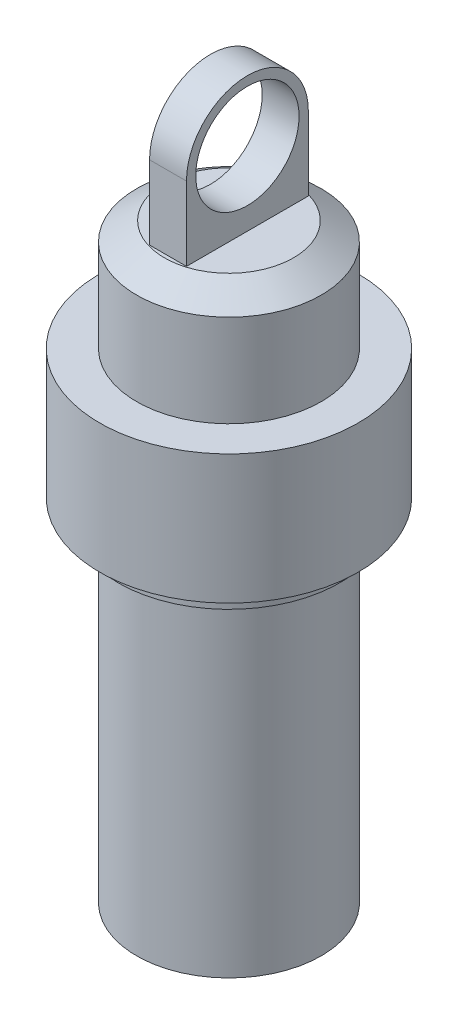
ISO-10303-21;
HEADER;
FILE_DESCRIPTION(('STEP AP214'),'2;1');
FILE_NAME('part.step','',(''),(''),'','','');
FILE_SCHEMA(('AUTOMOTIVE_DESIGN { 1 0 10303 214 1 1 1 1 }'));
ENDSEC;
DATA;
#1=APPLICATION_CONTEXT('core data for automotive mechanical design processes');
#2=APPLICATION_PROTOCOL_DEFINITION('international standard','automotive_design',2000,#1);
#3=PRODUCT_CONTEXT('',#1,'mechanical');
#4=PRODUCT('Part','Part','',(#3));
#5=PRODUCT_RELATED_PRODUCT_CATEGORY('part','',(#4));
#6=PRODUCT_DEFINITION_FORMATION('','',#4);
#7=PRODUCT_DEFINITION_CONTEXT('part definition',#1,'design');
#8=PRODUCT_DEFINITION('design','',#6,#7);
#9=PRODUCT_DEFINITION_SHAPE('','',#8);
#10=(LENGTH_UNIT() NAMED_UNIT(*) SI_UNIT(.MILLI.,.METRE.));
#11=(NAMED_UNIT(*) PLANE_ANGLE_UNIT() SI_UNIT($,.RADIAN.));
#12=(NAMED_UNIT(*) SI_UNIT($,.STERADIAN.) SOLID_ANGLE_UNIT());
#13=UNCERTAINTY_MEASURE_WITH_UNIT(LENGTH_MEASURE(1.E-05),#10,'distance_accuracy_value','');
#14=(GEOMETRIC_REPRESENTATION_CONTEXT(3) GLOBAL_UNCERTAINTY_ASSIGNED_CONTEXT((#13)) GLOBAL_UNIT_ASSIGNED_CONTEXT((#10,
#11,#12)) REPRESENTATION_CONTEXT('',''));
#15=CARTESIAN_POINT('',(0.,0.,0.));
#16=DIRECTION('',(0.,0.,1.));
#17=DIRECTION('',(1.,0.,0.));
#18=AXIS2_PLACEMENT_3D('',#15,#16,#17);
#19=CARTESIAN_POINT('',(-1.,32.,0.));
#20=DIRECTION('',(0.,1.,0.));
#21=DIRECTION('',(0.,0.,1.));
#22=AXIS2_PLACEMENT_3D('',#19,#20,#21);
#23=PLANE('',#22);
#24=DIRECTION('',(1.,0.,0.));
#25=VECTOR('',#24,1.);
#26=CARTESIAN_POINT('',(-1.,32.,-3.3));
#27=LINE('',#26,#25);
#28=CARTESIAN_POINT('',(-1.,32.,-3.3));
#29=VERTEX_POINT('',#28);
#30=CARTESIAN_POINT('',(1.,32.,-3.3));
#31=VERTEX_POINT('',#30);
#32=EDGE_CURVE('E47',#29,#31,#27,.T.);
#33=ORIENTED_EDGE('',*,*,#32,.T.);
#34=DIRECTION('',(0.,0.,1.));
#35=VECTOR('',#34,1.);
#36=CARTESIAN_POINT('',(1.,32.,0.));
#37=LINE('',#36,#35);
#38=CARTESIAN_POINT('',(1.,32.,3.3));
#39=VERTEX_POINT('',#38);
#40=EDGE_CURVE('E86',#31,#39,#37,.T.);
#41=ORIENTED_EDGE('',*,*,#40,.T.);
#42=DIRECTION('',(1.,0.,0.));
#43=VECTOR('',#42,1.);
#44=CARTESIAN_POINT('',(-1.,32.,3.3));
#45=LINE('',#44,#43);
#46=CARTESIAN_POINT('',(-1.,32.,3.3));
#47=VERTEX_POINT('',#46);
#48=EDGE_CURVE('E12',#47,#39,#45,.T.);
#49=ORIENTED_EDGE('',*,*,#48,.F.);
#50=DIRECTION('',(0.,0.,1.));
#51=VECTOR('',#50,1.);
#52=CARTESIAN_POINT('',(-1.,32.,0.));
#53=LINE('',#52,#51);
#54=EDGE_CURVE('E88',#29,#47,#53,.T.);
#55=ORIENTED_EDGE('',*,*,#54,.F.);
#56=EDGE_LOOP('',(#33,#41,#49,#55));
#57=FACE_BOUND('',#56,.T.);
#58=ADVANCED_FACE('F44',(#57),#23,.F.);
#59=CARTESIAN_POINT('',(-1.,0.,3.3));
#60=DIRECTION('',(0.,0.,-1.));
#61=DIRECTION('',(0.,1.,0.));
#62=AXIS2_PLACEMENT_3D('',#59,#60,#61);
#63=PLANE('',#62);
#64=ORIENTED_EDGE('',*,*,#48,.T.);
#65=DIRECTION('',(0.,1.,0.));
#66=VECTOR('',#65,1.);
#67=CARTESIAN_POINT('',(1.,0.,3.3));
#68=LINE('',#67,#66);
#69=CARTESIAN_POINT('',(1.,36.,3.3));
#70=VERTEX_POINT('',#69);
#71=EDGE_CURVE('E101',#39,#70,#68,.T.);
#72=ORIENTED_EDGE('',*,*,#71,.T.);
#73=DIRECTION('',(1.,0.,0.));
#74=VECTOR('',#73,1.);
#75=CARTESIAN_POINT('',(-1.,36.,3.3));
#76=LINE('',#75,#74);
#77=CARTESIAN_POINT('',(-1.,36.,3.3));
#78=VERTEX_POINT('',#77);
#79=EDGE_CURVE('E52',#78,#70,#76,.T.);
#80=ORIENTED_EDGE('',*,*,#79,.F.);
#81=DIRECTION('',(0.,1.,0.));
#82=VECTOR('',#81,1.);
#83=CARTESIAN_POINT('',(-1.,0.,3.3));
#84=LINE('',#83,#82);
#85=EDGE_CURVE('E59',#47,#78,#84,.T.);
#86=ORIENTED_EDGE('',*,*,#85,.F.);
#87=EDGE_LOOP('',(#64,#72,#80,#86));
#88=FACE_BOUND('',#87,.T.);
#89=ADVANCED_FACE('F124',(#88),#63,.F.);
#90=CARTESIAN_POINT('',(-1.,36.,0.));
#91=DIRECTION('',(1.,0.,0.));
#92=DIRECTION('',(0.,0.,-1.));
#93=AXIS2_PLACEMENT_3D('',#90,#91,#92);
#94=CYLINDRICAL_SURFACE('',#93,3.3);
#95=ORIENTED_EDGE('',*,*,#79,.T.);
#96=CARTESIAN_POINT('',(1.,36.,0.));
#97=DIRECTION('',(1.,0.,0.));
#98=DIRECTION('',(0.,0.,-1.));
#99=AXIS2_PLACEMENT_3D('',#96,#97,#98);
#100=CIRCLE('',#99,3.3);
#101=CARTESIAN_POINT('',(1.,36.,-3.3));
#102=VERTEX_POINT('',#101);
#103=EDGE_CURVE('E105',#102,#70,#100,.T.);
#104=ORIENTED_EDGE('',*,*,#103,.F.);
#105=DIRECTION('',(1.,0.,0.));
#106=VECTOR('',#105,1.);
#107=CARTESIAN_POINT('',(-1.,36.,-3.3));
#108=LINE('',#107,#106);
#109=CARTESIAN_POINT('',(-1.,36.,-3.3));
#110=VERTEX_POINT('',#109);
#111=EDGE_CURVE('E92',#110,#102,#108,.T.);
#112=ORIENTED_EDGE('',*,*,#111,.F.);
#113=CARTESIAN_POINT('',(-1.,36.,0.));
#114=DIRECTION('',(1.,0.,0.));
#115=DIRECTION('',(0.,0.,-1.));
#116=AXIS2_PLACEMENT_3D('',#113,#114,#115);
#117=CIRCLE('',#116,3.3);
#118=EDGE_CURVE('E116',#110,#78,#117,.T.);
#119=ORIENTED_EDGE('',*,*,#118,.T.);
#120=EDGE_LOOP('',(#95,#104,#112,#119));
#121=FACE_BOUND('',#120,.T.);
#122=ADVANCED_FACE('F123',(#121),#94,.T.);
#123=CARTESIAN_POINT('',(-1.,0.,-3.3));
#124=DIRECTION('',(0.,0.,1.));
#125=DIRECTION('',(0.,-1.,0.));
#126=AXIS2_PLACEMENT_3D('',#123,#124,#125);
#127=PLANE('',#126);
#128=ORIENTED_EDGE('',*,*,#111,.T.);
#129=DIRECTION('',(0.,-1.,0.));
#130=VECTOR('',#129,1.);
#131=CARTESIAN_POINT('',(1.,0.,-3.3));
#132=LINE('',#131,#130);
#133=EDGE_CURVE('E99',#102,#31,#132,.T.);
#134=ORIENTED_EDGE('',*,*,#133,.T.);
#135=ORIENTED_EDGE('',*,*,#32,.F.);
#136=DIRECTION('',(0.,-1.,0.));
#137=VECTOR('',#136,1.);
#138=CARTESIAN_POINT('',(-1.,0.,-3.3));
#139=LINE('',#138,#137);
#140=EDGE_CURVE('E114',#110,#29,#139,.T.);
#141=ORIENTED_EDGE('',*,*,#140,.F.);
#142=EDGE_LOOP('',(#128,#134,#135,#141));
#143=FACE_BOUND('',#142,.T.);
#144=ADVANCED_FACE('F103',(#143),#127,.F.);
#145=CARTESIAN_POINT('',(-1.,36.,0.));
#146=DIRECTION('',(1.,0.,0.));
#147=DIRECTION('',(0.,0.,-1.));
#148=AXIS2_PLACEMENT_3D('',#145,#146,#147);
#149=CYLINDRICAL_SURFACE('',#148,2.8);
#150=CARTESIAN_POINT('',(-1.,36.,0.));
#151=DIRECTION('',(1.,0.,0.));
#152=DIRECTION('',(0.,0.,-1.));
#153=AXIS2_PLACEMENT_3D('',#150,#151,#152);
#154=CIRCLE('',#153,2.8);
#155=CARTESIAN_POINT('',(-1.,36.,-2.8));
#156=VERTEX_POINT('',#155);
#157=EDGE_CURVE('E93',#156,#156,#154,.T.);
#158=ORIENTED_EDGE('',*,*,#157,.F.);
#159=EDGE_LOOP('',(#158));
#160=FACE_BOUND('',#159,.T.);
#161=CARTESIAN_POINT('',(1.,36.,0.));
#162=DIRECTION('',(1.,0.,0.));
#163=DIRECTION('',(0.,0.,-1.));
#164=AXIS2_PLACEMENT_3D('',#161,#162,#163);
#165=CIRCLE('',#164,2.8);
#166=CARTESIAN_POINT('',(1.,36.,-2.8));
#167=VERTEX_POINT('',#166);
#168=EDGE_CURVE('E110',#167,#167,#165,.T.);
#169=ORIENTED_EDGE('',*,*,#168,.T.);
#170=EDGE_LOOP('',(#169));
#171=FACE_BOUND('',#170,.T.);
#172=ADVANCED_FACE('F133',(#160,#171),#149,.F.);
#173=CARTESIAN_POINT('',(-1.,0.,0.));
#174=DIRECTION('',(1.,0.,0.));
#175=DIRECTION('',(0.,0.,-1.));
#176=AXIS2_PLACEMENT_3D('',#173,#174,#175);
#177=PLANE('',#176);
#178=ORIENTED_EDGE('',*,*,#54,.T.);
#179=ORIENTED_EDGE('',*,*,#85,.T.);
#180=ORIENTED_EDGE('',*,*,#118,.F.);
#181=ORIENTED_EDGE('',*,*,#140,.T.);
#182=EDGE_LOOP('',(#178,#179,#180,#181));
#183=FACE_BOUND('',#182,.T.);
#184=ORIENTED_EDGE('',*,*,#157,.T.);
#185=EDGE_LOOP('',(#184));
#186=FACE_BOUND('',#185,.T.);
#187=ADVANCED_FACE('F139',(#183,#186),#177,.F.);
#188=CARTESIAN_POINT('',(1.,0.,0.));
#189=DIRECTION('',(1.,0.,0.));
#190=DIRECTION('',(0.,0.,-1.));
#191=AXIS2_PLACEMENT_3D('',#188,#189,#190);
#192=PLANE('',#191);
#193=ORIENTED_EDGE('',*,*,#40,.F.);
#194=ORIENTED_EDGE('',*,*,#133,.F.);
#195=ORIENTED_EDGE('',*,*,#103,.T.);
#196=ORIENTED_EDGE('',*,*,#71,.F.);
#197=EDGE_LOOP('',(#193,#194,#195,#196));
#198=FACE_BOUND('',#197,.T.);
#199=ORIENTED_EDGE('',*,*,#168,.F.);
#200=EDGE_LOOP('',(#199));
#201=FACE_BOUND('',#200,.T.);
#202=ADVANCED_FACE('F96',(#198,#201),#192,.T.);
#203=CLOSED_SHELL('',(#58,#89,#122,#144,#172,#187,#202));
#204=MANIFOLD_SOLID_BREP('B2',#203);
#205=CARTESIAN_POINT('',(0.,27.,-0.75));
#206=DIRECTION('',(0.,-1.,0.));
#207=DIRECTION('',(0.,0.,-1.));
#208=AXIS2_PLACEMENT_3D('',#205,#206,#207);
#209=PLANE('',#208);
#210=CARTESIAN_POINT('',(0.,27.,0.));
#211=DIRECTION('',(0.,-1.,0.));
#212=DIRECTION('',(0.,0.,-1.));
#213=AXIS2_PLACEMENT_3D('',#210,#211,#212);
#214=CIRCLE('',#213,0.749999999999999);
#215=CARTESIAN_POINT('',(0.,27.,-0.75));
#216=VERTEX_POINT('',#215);
#217=EDGE_CURVE('E43',#216,#216,#214,.T.);
#218=ORIENTED_EDGE('',*,*,#217,.T.);
#219=EDGE_LOOP('',(#218));
#220=FACE_BOUND('',#219,.T.);
#221=ADVANCED_FACE('F200',(#220),#209,.T.);
#222=CARTESIAN_POINT('',(0.,0.,0.));
#223=DIRECTION('',(0.,-1.,0.));
#224=DIRECTION('',(0.,0.,-1.));
#225=AXIS2_PLACEMENT_3D('',#222,#223,#224);
#226=CYLINDRICAL_SURFACE('',#225,0.75);
#227=CARTESIAN_POINT('',(0.,2.,0.));
#228=DIRECTION('',(0.,-1.,0.));
#229=DIRECTION('',(0.,0.,-1.));
#230=AXIS2_PLACEMENT_3D('',#227,#228,#229);
#231=CIRCLE('',#230,0.75);
#232=CARTESIAN_POINT('',(0.,2.,-0.75));
#233=VERTEX_POINT('',#232);
#234=EDGE_CURVE('E206',#233,#233,#231,.T.);
#235=ORIENTED_EDGE('',*,*,#234,.T.);
#236=EDGE_LOOP('',(#235));
#237=FACE_BOUND('',#236,.T.);
#238=ORIENTED_EDGE('',*,*,#217,.F.);
#239=EDGE_LOOP('',(#238));
#240=FACE_BOUND('',#239,.T.);
#241=ADVANCED_FACE('F259',(#237,#240),#226,.F.);
#242=CARTESIAN_POINT('',(0.,2.,-2.));
#243=DIRECTION('',(0.,-1.,0.));
#244=DIRECTION('',(0.,0.,-1.));
#245=AXIS2_PLACEMENT_3D('',#242,#243,#244);
#246=PLANE('',#245);
#247=CARTESIAN_POINT('',(0.,2.,0.));
#248=DIRECTION('',(0.,-1.,0.));
#249=DIRECTION('',(0.,0.,-1.));
#250=AXIS2_PLACEMENT_3D('',#247,#248,#249);
#251=CIRCLE('',#250,2.);
#252=CARTESIAN_POINT('',(0.,2.,-2.));
#253=VERTEX_POINT('',#252);
#254=EDGE_CURVE('E210',#253,#253,#251,.T.);
#255=ORIENTED_EDGE('',*,*,#254,.T.);
#256=EDGE_LOOP('',(#255));
#257=FACE_BOUND('',#256,.T.);
#258=ORIENTED_EDGE('',*,*,#234,.F.);
#259=EDGE_LOOP('',(#258));
#260=FACE_BOUND('',#259,.T.);
#261=ADVANCED_FACE('F263',(#257,#260),#246,.T.);
#262=CARTESIAN_POINT('',(0.,0.,0.));
#263=DIRECTION('',(0.,-1.,0.));
#264=DIRECTION('',(0.,0.,-1.));
#265=AXIS2_PLACEMENT_3D('',#262,#263,#264);
#266=CYLINDRICAL_SURFACE('',#265,2.);
#267=CARTESIAN_POINT('',(0.,0.,0.));
#268=DIRECTION('',(0.,-1.,0.));
#269=DIRECTION('',(0.,0.,-1.));
#270=AXIS2_PLACEMENT_3D('',#267,#268,#269);
#271=CIRCLE('',#270,2.);
#272=CARTESIAN_POINT('',(0.,0.,-2.));
#273=VERTEX_POINT('',#272);
#274=EDGE_CURVE('E214',#273,#273,#271,.T.);
#275=ORIENTED_EDGE('',*,*,#274,.T.);
#276=EDGE_LOOP('',(#275));
#277=FACE_BOUND('',#276,.T.);
#278=ORIENTED_EDGE('',*,*,#254,.F.);
#279=EDGE_LOOP('',(#278));
#280=FACE_BOUND('',#279,.T.);
#281=ADVANCED_FACE('F267',(#277,#280),#266,.F.);
#282=CARTESIAN_POINT('',(0.,0.,-2.));
#283=DIRECTION('',(0.,-1.,0.));
#284=DIRECTION('',(0.,0.,-1.));
#285=AXIS2_PLACEMENT_3D('',#282,#283,#284);
#286=PLANE('',#285);
#287=CARTESIAN_POINT('',(0.,0.,0.));
#288=DIRECTION('',(0.,-1.,0.));
#289=DIRECTION('',(0.,0.,-1.));
#290=AXIS2_PLACEMENT_3D('',#287,#288,#289);
#291=CIRCLE('',#290,5.);
#292=CARTESIAN_POINT('',(0.,0.,-5.));
#293=VERTEX_POINT('',#292);
#294=EDGE_CURVE('E219',#293,#293,#291,.T.);
#295=ORIENTED_EDGE('',*,*,#294,.T.);
#296=EDGE_LOOP('',(#295));
#297=FACE_BOUND('',#296,.T.);
#298=ORIENTED_EDGE('',*,*,#274,.F.);
#299=EDGE_LOOP('',(#298));
#300=FACE_BOUND('',#299,.T.);
#301=ADVANCED_FACE('F274',(#297,#300),#286,.T.);
#302=CARTESIAN_POINT('',(0.,0.,0.));
#303=DIRECTION('',(0.,-1.,0.));
#304=DIRECTION('',(0.,0.,-1.));
#305=AXIS2_PLACEMENT_3D('',#302,#303,#304);
#306=CYLINDRICAL_SURFACE('',#305,5.);
#307=CARTESIAN_POINT('',(0.,18.,0.));
#308=DIRECTION('',(0.,-1.,0.));
#309=DIRECTION('',(0.,0.,-1.));
#310=AXIS2_PLACEMENT_3D('',#307,#308,#309);
#311=CIRCLE('',#310,5.);
#312=CARTESIAN_POINT('',(0.,18.,-5.));
#313=VERTEX_POINT('',#312);
#314=EDGE_CURVE('E222',#313,#313,#311,.T.);
#315=ORIENTED_EDGE('',*,*,#314,.T.);
#316=EDGE_LOOP('',(#315));
#317=FACE_BOUND('',#316,.T.);
#318=ORIENTED_EDGE('',*,*,#294,.F.);
#319=EDGE_LOOP('',(#318));
#320=FACE_BOUND('',#319,.T.);
#321=ADVANCED_FACE('F278',(#317,#320),#306,.T.);
#322=CARTESIAN_POINT('',(0.,18.,-5.));
#323=DIRECTION('',(0.,-1.,0.));
#324=DIRECTION('',(0.,0.,-1.));
#325=AXIS2_PLACEMENT_3D('',#322,#323,#324);
#326=PLANE('',#325);
#327=CARTESIAN_POINT('',(0.,18.,0.));
#328=DIRECTION('',(0.,-1.,0.));
#329=DIRECTION('',(0.,0.,-1.));
#330=AXIS2_PLACEMENT_3D('',#327,#328,#329);
#331=CIRCLE('',#330,6.);
#332=CARTESIAN_POINT('',(0.,18.,-6.));
#333=VERTEX_POINT('',#332);
#334=EDGE_CURVE('E225',#333,#333,#331,.T.);
#335=ORIENTED_EDGE('',*,*,#334,.T.);
#336=EDGE_LOOP('',(#335));
#337=FACE_BOUND('',#336,.T.);
#338=ORIENTED_EDGE('',*,*,#314,.F.);
#339=EDGE_LOOP('',(#338));
#340=FACE_BOUND('',#339,.T.);
#341=ADVANCED_FACE('F282',(#337,#340),#326,.T.);
#342=CARTESIAN_POINT('',(0.,0.,0.));
#343=DIRECTION('',(0.,-1.,0.));
#344=DIRECTION('',(0.,0.,-1.));
#345=AXIS2_PLACEMENT_3D('',#342,#343,#344);
#346=CYLINDRICAL_SURFACE('',#345,6.);
#347=CARTESIAN_POINT('',(0.,19.,0.));
#348=DIRECTION('',(0.,-1.,0.));
#349=DIRECTION('',(0.,0.,-1.));
#350=AXIS2_PLACEMENT_3D('',#347,#348,#349);
#351=CIRCLE('',#350,6.);
#352=CARTESIAN_POINT('',(0.,19.,-6.));
#353=VERTEX_POINT('',#352);
#354=EDGE_CURVE('E228',#353,#353,#351,.T.);
#355=ORIENTED_EDGE('',*,*,#354,.T.);
#356=EDGE_LOOP('',(#355));
#357=FACE_BOUND('',#356,.T.);
#358=ORIENTED_EDGE('',*,*,#334,.F.);
#359=EDGE_LOOP('',(#358));
#360=FACE_BOUND('',#359,.T.);
#361=ADVANCED_FACE('F286',(#357,#360),#346,.T.);
#362=CARTESIAN_POINT('',(0.,19.,-6.));
#363=DIRECTION('',(0.,-1.,0.));
#364=DIRECTION('',(0.,0.,-1.));
#365=AXIS2_PLACEMENT_3D('',#362,#363,#364);
#366=PLANE('',#365);
#367=CARTESIAN_POINT('',(0.,19.,0.));
#368=DIRECTION('',(0.,-1.,0.));
#369=DIRECTION('',(0.,0.,-1.));
#370=AXIS2_PLACEMENT_3D('',#367,#368,#369);
#371=CIRCLE('',#370,7.);
#372=CARTESIAN_POINT('',(0.,19.,-7.));
#373=VERTEX_POINT('',#372);
#374=EDGE_CURVE('E231',#373,#373,#371,.T.);
#375=ORIENTED_EDGE('',*,*,#374,.T.);
#376=EDGE_LOOP('',(#375));
#377=FACE_BOUND('',#376,.T.);
#378=ORIENTED_EDGE('',*,*,#354,.F.);
#379=EDGE_LOOP('',(#378));
#380=FACE_BOUND('',#379,.T.);
#381=ADVANCED_FACE('F290',(#377,#380),#366,.T.);
#382=CARTESIAN_POINT('',(0.,0.,0.));
#383=DIRECTION('',(0.,-1.,0.));
#384=DIRECTION('',(0.,0.,-1.));
#385=AXIS2_PLACEMENT_3D('',#382,#383,#384);
#386=CYLINDRICAL_SURFACE('',#385,7.);
#387=CARTESIAN_POINT('',(0.,26.,0.));
#388=DIRECTION('',(0.,-1.,0.));
#389=DIRECTION('',(0.,0.,-1.));
#390=AXIS2_PLACEMENT_3D('',#387,#388,#389);
#391=CIRCLE('',#390,7.);
#392=CARTESIAN_POINT('',(0.,26.,-7.));
#393=VERTEX_POINT('',#392);
#394=EDGE_CURVE('E234',#393,#393,#391,.T.);
#395=ORIENTED_EDGE('',*,*,#394,.T.);
#396=EDGE_LOOP('',(#395));
#397=FACE_BOUND('',#396,.T.);
#398=ORIENTED_EDGE('',*,*,#374,.F.);
#399=EDGE_LOOP('',(#398));
#400=FACE_BOUND('',#399,.T.);
#401=ADVANCED_FACE('F294',(#397,#400),#386,.T.);
#402=CARTESIAN_POINT('',(0.,26.,-7.));
#403=DIRECTION('',(0.,1.,0.));
#404=DIRECTION('',(0.,0.,1.));
#405=AXIS2_PLACEMENT_3D('',#402,#403,#404);
#406=PLANE('',#405);
#407=CARTESIAN_POINT('',(0.,26.,0.));
#408=DIRECTION('',(0.,-1.,0.));
#409=DIRECTION('',(0.,0.,-1.));
#410=AXIS2_PLACEMENT_3D('',#407,#408,#409);
#411=CIRCLE('',#410,5.);
#412=CARTESIAN_POINT('',(0.,26.,-5.));
#413=VERTEX_POINT('',#412);
#414=EDGE_CURVE('E237',#413,#413,#411,.T.);
#415=ORIENTED_EDGE('',*,*,#414,.T.);
#416=EDGE_LOOP('',(#415));
#417=FACE_BOUND('',#416,.T.);
#418=ORIENTED_EDGE('',*,*,#394,.F.);
#419=EDGE_LOOP('',(#418));
#420=FACE_BOUND('',#419,.T.);
#421=ADVANCED_FACE('F298',(#417,#420),#406,.T.);
#422=CARTESIAN_POINT('',(0.,0.,0.));
#423=DIRECTION('',(0.,-1.,0.));
#424=DIRECTION('',(0.,0.,-1.));
#425=AXIS2_PLACEMENT_3D('',#422,#423,#424);
#426=CYLINDRICAL_SURFACE('',#425,5.);
#427=CARTESIAN_POINT('',(0.,31.,0.));
#428=DIRECTION('',(0.,-1.,0.));
#429=DIRECTION('',(0.,0.,-1.));
#430=AXIS2_PLACEMENT_3D('',#427,#428,#429);
#431=CIRCLE('',#430,5.);
#432=CARTESIAN_POINT('',(0.,31.,-5.));
#433=VERTEX_POINT('',#432);
#434=EDGE_CURVE('E240',#433,#433,#431,.T.);
#435=ORIENTED_EDGE('',*,*,#434,.T.);
#436=EDGE_LOOP('',(#435));
#437=FACE_BOUND('',#436,.T.);
#438=ORIENTED_EDGE('',*,*,#414,.F.);
#439=EDGE_LOOP('',(#438));
#440=FACE_BOUND('',#439,.T.);
#441=ADVANCED_FACE('F256',(#437,#440),#426,.T.);
#442=CARTESIAN_POINT('',(0.,31.,0.));
#443=DIRECTION('',(0.,-1.,0.));
#444=DIRECTION('',(0.,0.,-1.));
#445=AXIS2_PLACEMENT_3D('',#442,#443,#444);
#446=CONICAL_SURFACE('',#445,5.,0.982793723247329);
#447=CARTESIAN_POINT('',(0.,32.,0.));
#448=DIRECTION('',(0.,-1.,0.));
#449=DIRECTION('',(0.,0.,-1.));
#450=AXIS2_PLACEMENT_3D('',#447,#448,#449);
#451=CIRCLE('',#450,3.5);
#452=CARTESIAN_POINT('',(0.,32.,-3.5));
#453=VERTEX_POINT('',#452);
#454=EDGE_CURVE('E243',#453,#453,#451,.T.);
#455=ORIENTED_EDGE('',*,*,#454,.T.);
#456=EDGE_LOOP('',(#455));
#457=FACE_BOUND('',#456,.T.);
#458=ORIENTED_EDGE('',*,*,#434,.F.);
#459=EDGE_LOOP('',(#458));
#460=FACE_BOUND('',#459,.T.);
#461=ADVANCED_FACE('F247',(#457,#460),#446,.T.);
#462=CARTESIAN_POINT('',(0.,32.,-3.5));
#463=DIRECTION('',(0.,1.,0.));
#464=DIRECTION('',(0.,0.,1.));
#465=AXIS2_PLACEMENT_3D('',#462,#463,#464);
#466=PLANE('',#465);
#467=ORIENTED_EDGE('',*,*,#454,.F.);
#468=EDGE_LOOP('',(#467));
#469=FACE_BOUND('',#468,.T.);
#470=ADVANCED_FACE('F250',(#469),#466,.T.);
#471=CLOSED_SHELL('',(#221,#241,#261,#281,#301,#321,#341,#361,#381,#401,#421,#441,#461,#470));
#472=MANIFOLD_SOLID_BREP('B6',#471);
#473=ADVANCED_BREP_SHAPE_REPRESENTATION('',(#18,#204,#472),#14);
#474=SHAPE_DEFINITION_REPRESENTATION(#9,#473);
ENDSEC;
END-ISO-10303-21;
